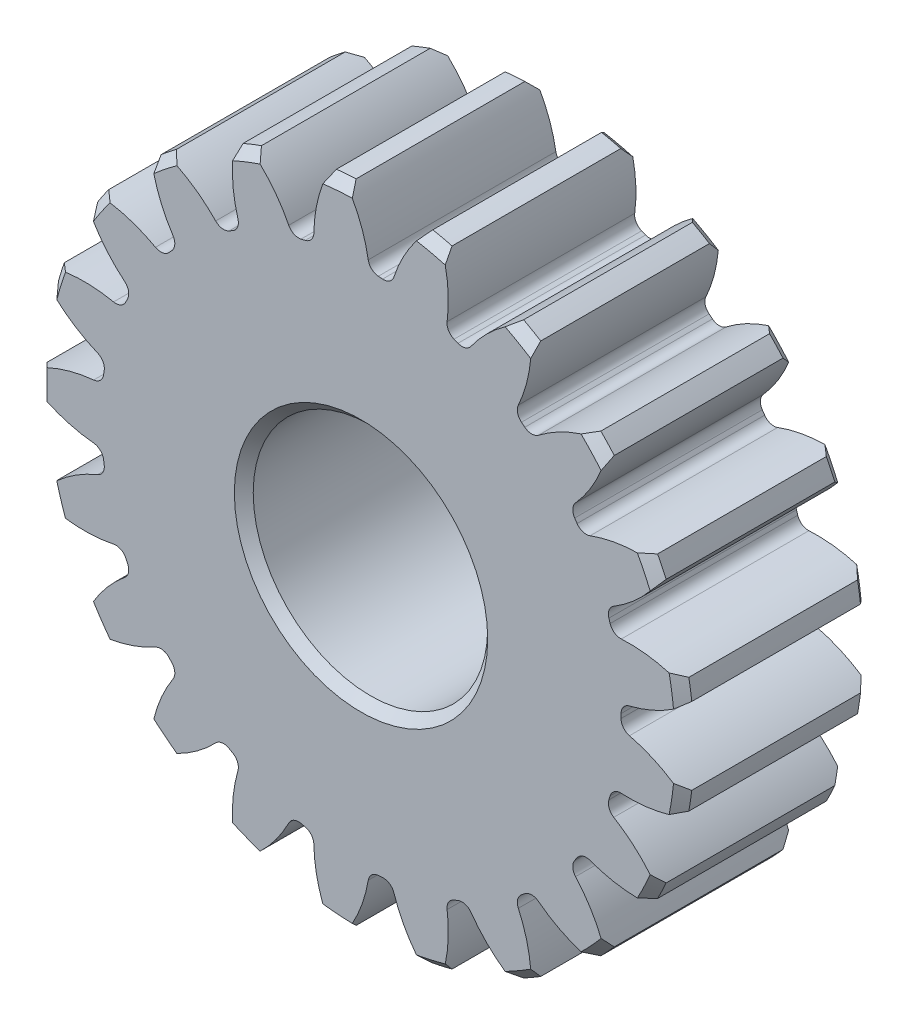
from build123d import *

# Parameters (mm, degrees)
BOSS_EXTRUDE1_DEPTH      = 1
BOSS_EXTRUDE1_DEPTH_BACK = 1
SKETCH3_R                = 3.45
SKETCH5_W                = 2
SKETCH5_H                = 1.25
CHAMFER2_SIZE            = 0.100651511
CUT_EXTRUDE1_DEPTH       = 5.980461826
FILLET1_R                = 0.117809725
CIRPATTERN1_COUNT        = 21
FILLET1_OF_CIRPATTERN1_R = 0.117809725


with BuildPart() as part:
    # Sketch3 → Boss-Extrude1 (new, two sides: drawn at the far end of the back side and taken through both)
    with BuildSketch(Plane.XY.offset(-BOSS_EXTRUDE1_DEPTH_BACK)):
        Circle(SKETCH3_R)
    extrude(amount=BOSS_EXTRUDE1_DEPTH + BOSS_EXTRUDE1_DEPTH_BACK)

    # Sketch5 → Cut-Revolve1 (revolve, cut)
    with BuildSketch(Plane(origin=(0, 0, 0), x_dir=(0, 0, -1), z_dir=(1, 0, 0)), mode=Mode.PRIVATE) as cut_revolve1_sk:
        with Locations((0, 0.625)):
            Rectangle(SKETCH5_W, SKETCH5_H)
    revolve(cut_revolve1_sk.sketch.rotate(Axis((0, 0, 1), (0, 0, -1)), 90), axis=Axis((0, 0, 1), (0, 0, -1)), mode=Mode.SUBTRACT)

    # Chamfer2
    chamfer2_edges = [part.edges().sort_by_distance(p)[0] for p in [
        (-3.45, 0, -1),
        (-3.45, 0, 1),
        (-1.25, 0, 1),
        (-1.25, 0, -1),
    ]]
    chamfer(chamfer2_edges, length=CHAMFER2_SIZE)

    # Sketch4 → Cut-Extrude1 (cut, symmetric)
    with BuildSketch(Plane.XY):
        with BuildLine():
            Line((2.772498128, -0.117809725), (2.772498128, 0.117809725))
            ThreePointArc((2.772498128, 0.117809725), (3.116480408, 0.2249138), (3.425545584, 0.410045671))
            ThreePointArc((3.425545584, 0.410045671), (3.45, 0), (3.425545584, -0.410045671))
            ThreePointArc((3.425545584, -0.410045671), (3.116480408, -0.2249138), (2.772498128, -0.117809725))
        make_face()
    cut_extrude1 = extrude(amount=CUT_EXTRUDE1_DEPTH, both=True, mode=Mode.SUBTRACT)

    # Fillet1
    fillet1_edges = [part.edges().sort_by_distance(p)[0] for p in [
        (2.772498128, 0.117809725, 0),
        (2.772498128, -0.117809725, 0),
    ]]
    fillet(fillet1_edges, radius=FILLET1_R)

    # CirPattern1: Cut-Extrude1 ×21 about axis
    cirpattern1_axis = Axis((0, 0, 0), (0, 0, 1))
    for i in range(1, CIRPATTERN1_COUNT):
        add(cut_extrude1.rotate(cirpattern1_axis, i * 360 / CIRPATTERN1_COUNT), mode=Mode.SUBTRACT)

    # Fillet1 of CirPattern1
    fillet1_of_cirpattern1_edges = [part.edges().sort_by_distance(p)[0] for p in [
        (2.614598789, 0.929783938, 0),
        (2.684048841, 0.7046324, 0),
        (2.224380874, 1.659142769, 0),
        (2.357110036, 1.464464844, 0),
        (1.636516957, 2.241079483, 0),
        (1.82073166, 2.09417316, 0),
        (0.903241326, 2.623886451, 0),
        (1.122573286, 2.537805, 0),
        (0.08970874, 2.773549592, 0),
        (0.324669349, 2.755941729, 0),
        (-0.731794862, 2.676770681, 0),
        (-0.502082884, 2.729200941, 0),
        (-1.488275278, 2.342148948, 0),
        (-1.28422285, 2.459958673, 0),
        (-2.112515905, 1.799417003, 0),
        (-1.952253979, 1.972138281, 0),
        (-2.549050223, 1.09679896, 0),
        (-2.446818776, 1.309084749, 0),
        (-2.759090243, 0.296725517, 0),
        (-2.723972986, 0.529713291, 0),
        (-2.723972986, -0.529713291, 0),
        (-2.759090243, -0.296725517, 0),
        (-2.446818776, -1.309084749, 0),
        (-2.549050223, -1.09679896, 0),
        (-1.952253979, -1.972138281, 0),
        (-2.112515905, -1.799417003, 0),
        (-1.28422285, -2.459958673, 0),
        (-1.488275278, -2.342148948, 0),
        (-0.502082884, -2.729200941, 0),
        (-0.731794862, -2.676770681, 0),
        (0.324669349, -2.755941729, 0),
        (0.08970874, -2.773549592, 0),
        (1.122573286, -2.537805, 0),
        (0.903241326, -2.623886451, 0),
        (1.82073166, -2.09417316, 0),
        (1.636516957, -2.241079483, 0),
        (2.357110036, -1.464464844, 0),
        (2.224380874, -1.659142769, 0),
        (2.684048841, -0.7046324, 0),
        (2.614598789, -0.929783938, 0),
    ]]
    fillet(fillet1_of_cirpattern1_edges, radius=FILLET1_OF_CIRPATTERN1_R)


solid = part.part
